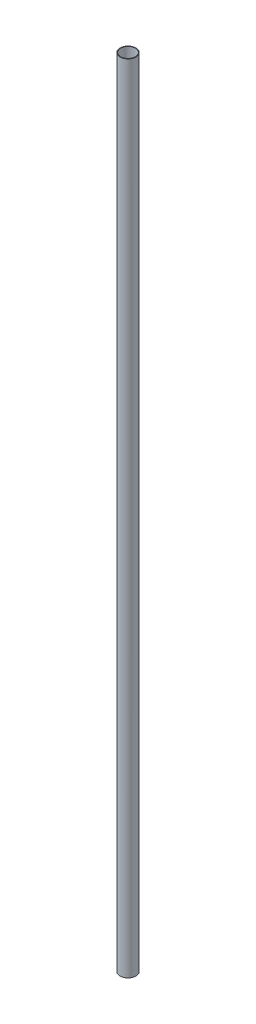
from build123d import *

# Parameters (mm, degrees)
BASE_EXTRUSION_DEPTH      = 3000
BASE_EXTRUSION_DEPTH_BACK = 23
ESQUISSE1_R               = 30
ESQUISSE1_R_2             = 28
ENL_V_MAT_EXTRU_1_DEPTH   = 3001.299985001
ESQUISSE3_R               = 5
ENL_V_MAT_EXTRU_4_DEPTH   = 3001.299985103


with BuildPart() as part:
    # Esquisse1 → Base-Extrusion (new, two sides: drawn at the far end of the back side and taken through both)
    with BuildSketch(Plane(origin=(0, 0, 0), x_dir=(1, 0, 0), z_dir=(0, 1, 0)).offset(-BASE_EXTRUSION_DEPTH_BACK)):
        with Locations(Location((0, 0, 0), (0, 0, 270))):
            Circle(ESQUISSE1_R)
        with Locations(Location((0, 0, 0), (0, 0, 270))):
            Circle(ESQUISSE1_R_2, mode=Mode.SUBTRACT)
    extrude(amount=BASE_EXTRUSION_DEPTH + BASE_EXTRUSION_DEPTH_BACK)

    # Esquisse2 → Enl_v. mat.-Extru.1 (cut, through all)
    with BuildSketch(Plane(origin=(0, 0, 0), x_dir=(0, 0, -1), z_dir=(1, 0, 0))):
        with BuildLine():
            Line((-23, -30), (-23, 5))
            ThreePointArc((-23, 5), (0, 28), (23, 5))
            Line((23, 5), (23, -30))
            Line((23, -30), (-23, -30))
        make_face()
    extrude(amount=-ENL_V_MAT_EXTRU_1_DEPTH, mode=Mode.SUBTRACT)

    # Esquisse3 → Enl_v. mat.-Extru.4 (cut, through all)
    with BuildSketch(Plane(origin=(0, 0, 0), x_dir=(0, 0, -1), z_dir=(1, 0, 0))):
        with Locations((0, 47.5)):
            Circle(ESQUISSE3_R)
        with Locations((0, 107.5)):
            Circle(ESQUISSE3_R)
    extrude(amount=-ENL_V_MAT_EXTRU_4_DEPTH, mode=Mode.SUBTRACT)


solid = part.part
